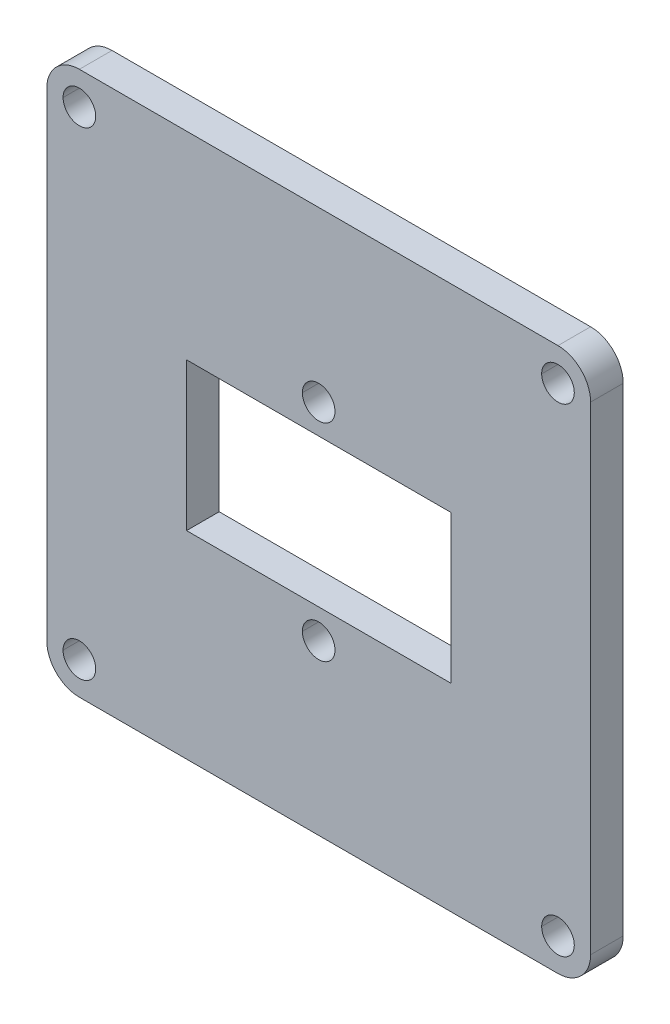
ISO-10303-21;
HEADER;
FILE_DESCRIPTION(('STEP AP214'),'2;1');
FILE_NAME('part.step','',(''),(''),'','','');
FILE_SCHEMA(('AUTOMOTIVE_DESIGN { 1 0 10303 214 1 1 1 1 }'));
ENDSEC;
DATA;
#1=APPLICATION_CONTEXT('core data for automotive mechanical design processes');
#2=APPLICATION_PROTOCOL_DEFINITION('international standard','automotive_design',2000,#1);
#3=PRODUCT_CONTEXT('',#1,'mechanical');
#4=PRODUCT('Part','Part','',(#3));
#5=PRODUCT_RELATED_PRODUCT_CATEGORY('part','',(#4));
#6=PRODUCT_DEFINITION_FORMATION('','',#4);
#7=PRODUCT_DEFINITION_CONTEXT('part definition',#1,'design');
#8=PRODUCT_DEFINITION('design','',#6,#7);
#9=PRODUCT_DEFINITION_SHAPE('','',#8);
#10=(LENGTH_UNIT() NAMED_UNIT(*) SI_UNIT(.MILLI.,.METRE.));
#11=(NAMED_UNIT(*) PLANE_ANGLE_UNIT() SI_UNIT($,.RADIAN.));
#12=(NAMED_UNIT(*) SI_UNIT($,.STERADIAN.) SOLID_ANGLE_UNIT());
#13=UNCERTAINTY_MEASURE_WITH_UNIT(LENGTH_MEASURE(1.E-05),#10,'distance_accuracy_value','');
#14=(GEOMETRIC_REPRESENTATION_CONTEXT(3) GLOBAL_UNCERTAINTY_ASSIGNED_CONTEXT((#13)) GLOBAL_UNIT_ASSIGNED_CONTEXT((#10,
#11,#12)) REPRESENTATION_CONTEXT('',''));
#15=CARTESIAN_POINT('',(0.,0.,0.));
#16=DIRECTION('',(0.,0.,1.));
#17=DIRECTION('',(1.,0.,0.));
#18=AXIS2_PLACEMENT_3D('',#15,#16,#17);
#19=CARTESIAN_POINT('',(25.1876211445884,-107.615333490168,0.));
#20=DIRECTION('',(0.,0.,1.));
#21=DIRECTION('',(1.,0.,0.));
#22=AXIS2_PLACEMENT_3D('',#19,#20,#21);
#23=PLANE('',#22);
#24=CARTESIAN_POINT('',(69.1876211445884,-107.615333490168,0.));
#25=DIRECTION('',(0.,0.,-1.));
#26=DIRECTION('',(-1.,0.,0.));
#27=AXIS2_PLACEMENT_3D('',#24,#25,#26);
#28=CIRCLE('',#27,1.5);
#29=CARTESIAN_POINT('',(70.6876211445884,-107.615333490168,0.));
#30=VERTEX_POINT('',#29);
#31=CARTESIAN_POINT('',(67.6876211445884,-107.615333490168,0.));
#32=VERTEX_POINT('',#31);
#33=EDGE_CURVE('E310',#30,#32,#28,.F.);
#34=ORIENTED_EDGE('',*,*,#33,.T.);
#35=CARTESIAN_POINT('',(69.1876211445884,-107.615333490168,0.));
#36=DIRECTION('',(0.,0.,-1.));
#37=DIRECTION('',(-1.,0.,0.));
#38=AXIS2_PLACEMENT_3D('',#35,#36,#37);
#39=CIRCLE('',#38,1.5);
#40=EDGE_CURVE('E33',#32,#30,#39,.F.);
#41=ORIENTED_EDGE('',*,*,#40,.T.);
#42=EDGE_LOOP('',(#34,#41));
#43=FACE_BOUND('',#42,.T.);
#44=CARTESIAN_POINT('',(25.1876211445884,-63.6153334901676,0.));
#45=DIRECTION('',(0.,0.,-1.));
#46=DIRECTION('',(-1.,0.,0.));
#47=AXIS2_PLACEMENT_3D('',#44,#45,#46);
#48=CIRCLE('',#47,1.5);
#49=CARTESIAN_POINT('',(26.6876211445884,-63.6153334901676,0.));
#50=VERTEX_POINT('',#49);
#51=CARTESIAN_POINT('',(23.6876211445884,-63.6153334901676,0.));
#52=VERTEX_POINT('',#51);
#53=EDGE_CURVE('E303',#50,#52,#48,.F.);
#54=ORIENTED_EDGE('',*,*,#53,.T.);
#55=CARTESIAN_POINT('',(25.1876211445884,-63.6153334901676,0.));
#56=DIRECTION('',(0.,0.,-1.));
#57=DIRECTION('',(-1.,0.,0.));
#58=AXIS2_PLACEMENT_3D('',#55,#56,#57);
#59=CIRCLE('',#58,1.5);
#60=EDGE_CURVE('E313',#52,#50,#59,.F.);
#61=ORIENTED_EDGE('',*,*,#60,.T.);
#62=EDGE_LOOP('',(#54,#61));
#63=FACE_BOUND('',#62,.T.);
#64=CARTESIAN_POINT('',(47.1876211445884,-76.1153334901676,0.));
#65=DIRECTION('',(0.,0.,-1.));
#66=DIRECTION('',(-1.,0.,0.));
#67=AXIS2_PLACEMENT_3D('',#64,#65,#66);
#68=CIRCLE('',#67,1.5);
#69=CARTESIAN_POINT('',(48.6876211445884,-76.1153334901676,0.));
#70=VERTEX_POINT('',#69);
#71=CARTESIAN_POINT('',(45.6876211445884,-76.1153334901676,0.));
#72=VERTEX_POINT('',#71);
#73=EDGE_CURVE('E297',#70,#72,#68,.F.);
#74=ORIENTED_EDGE('',*,*,#73,.T.);
#75=CARTESIAN_POINT('',(47.1876211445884,-76.1153334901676,0.));
#76=DIRECTION('',(0.,0.,-1.));
#77=DIRECTION('',(-1.,0.,0.));
#78=AXIS2_PLACEMENT_3D('',#75,#76,#77);
#79=CIRCLE('',#78,1.5);
#80=EDGE_CURVE('E306',#72,#70,#79,.F.);
#81=ORIENTED_EDGE('',*,*,#80,.T.);
#82=EDGE_LOOP('',(#74,#81));
#83=FACE_BOUND('',#82,.T.);
#84=DIRECTION('',(0.,1.,0.));
#85=VECTOR('',#84,1.);
#86=CARTESIAN_POINT('',(22.1876211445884,-63.6153334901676,0.));
#87=LINE('',#86,#85);
#88=CARTESIAN_POINT('',(22.1876211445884,-107.615333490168,0.));
#89=VERTEX_POINT('',#88);
#90=CARTESIAN_POINT('',(22.1876211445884,-63.6153334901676,0.));
#91=VERTEX_POINT('',#90);
#92=EDGE_CURVE('E272',#89,#91,#87,.T.);
#93=ORIENTED_EDGE('',*,*,#92,.T.);
#94=CARTESIAN_POINT('',(25.1876211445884,-63.6153334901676,0.));
#95=DIRECTION('',(0.,0.,-1.));
#96=DIRECTION('',(-1.,0.,0.));
#97=AXIS2_PLACEMENT_3D('',#94,#95,#96);
#98=CIRCLE('',#97,3.);
#99=CARTESIAN_POINT('',(25.1876211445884,-60.6153334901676,0.));
#100=VERTEX_POINT('',#99);
#101=EDGE_CURVE('E275',#100,#91,#98,.F.);
#102=ORIENTED_EDGE('',*,*,#101,.F.);
#103=DIRECTION('',(1.,0.,0.));
#104=VECTOR('',#103,1.);
#105=CARTESIAN_POINT('',(25.1876211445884,-60.6153334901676,0.));
#106=LINE('',#105,#104);
#107=CARTESIAN_POINT('',(69.1876211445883,-60.6153334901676,0.));
#108=VERTEX_POINT('',#107);
#109=EDGE_CURVE('E278',#100,#108,#106,.T.);
#110=ORIENTED_EDGE('',*,*,#109,.T.);
#111=CARTESIAN_POINT('',(69.1876211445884,-63.6153334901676,0.));
#112=DIRECTION('',(0.,0.,-1.));
#113=DIRECTION('',(-1.,0.,0.));
#114=AXIS2_PLACEMENT_3D('',#111,#112,#113);
#115=CIRCLE('',#114,3.);
#116=CARTESIAN_POINT('',(72.1876211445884,-63.6153334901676,0.));
#117=VERTEX_POINT('',#116);
#118=EDGE_CURVE('E282',#117,#108,#115,.F.);
#119=ORIENTED_EDGE('',*,*,#118,.F.);
#120=DIRECTION('',(0.,-1.,0.));
#121=VECTOR('',#120,1.);
#122=CARTESIAN_POINT('',(72.1876211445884,-63.6153334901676,0.));
#123=LINE('',#122,#121);
#124=CARTESIAN_POINT('',(72.1876211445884,-107.615333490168,0.));
#125=VERTEX_POINT('',#124);
#126=EDGE_CURVE('E285',#117,#125,#123,.T.);
#127=ORIENTED_EDGE('',*,*,#126,.T.);
#128=CARTESIAN_POINT('',(69.1876211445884,-107.615333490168,0.));
#129=DIRECTION('',(0.,0.,-1.));
#130=DIRECTION('',(-1.,0.,0.));
#131=AXIS2_PLACEMENT_3D('',#128,#129,#130);
#132=CIRCLE('',#131,3.);
#133=CARTESIAN_POINT('',(69.1876211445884,-110.615333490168,0.));
#134=VERTEX_POINT('',#133);
#135=EDGE_CURVE('E289',#134,#125,#132,.F.);
#136=ORIENTED_EDGE('',*,*,#135,.F.);
#137=DIRECTION('',(1.,0.,0.));
#138=VECTOR('',#137,1.);
#139=CARTESIAN_POINT('',(25.1876211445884,-110.615333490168,0.));
#140=LINE('',#139,#138);
#141=CARTESIAN_POINT('',(25.1876211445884,-110.615333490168,0.));
#142=VERTEX_POINT('',#141);
#143=EDGE_CURVE('E292',#134,#142,#140,.F.);
#144=ORIENTED_EDGE('',*,*,#143,.T.);
#145=CARTESIAN_POINT('',(25.1876211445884,-107.615333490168,0.));
#146=DIRECTION('',(0.,0.,-1.));
#147=DIRECTION('',(-1.,0.,0.));
#148=AXIS2_PLACEMENT_3D('',#145,#146,#147);
#149=CIRCLE('',#148,3.);
#150=EDGE_CURVE('E293',#89,#142,#149,.F.);
#151=ORIENTED_EDGE('',*,*,#150,.F.);
#152=EDGE_LOOP('',(#93,#102,#110,#119,#127,#136,#144,#151));
#153=FACE_BOUND('',#152,.T.);
#154=CARTESIAN_POINT('',(47.1876211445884,-95.1153334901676,0.));
#155=DIRECTION('',(0.,0.,-1.));
#156=DIRECTION('',(-1.,0.,0.));
#157=AXIS2_PLACEMENT_3D('',#154,#155,#156);
#158=CIRCLE('',#157,1.5);
#159=CARTESIAN_POINT('',(48.6876211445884,-95.1153334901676,0.));
#160=VERTEX_POINT('',#159);
#161=CARTESIAN_POINT('',(45.6876211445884,-95.1153334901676,0.));
#162=VERTEX_POINT('',#161);
#163=EDGE_CURVE('E262',#160,#162,#158,.F.);
#164=ORIENTED_EDGE('',*,*,#163,.T.);
#165=CARTESIAN_POINT('',(47.1876211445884,-95.1153334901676,0.));
#166=DIRECTION('',(0.,0.,-1.));
#167=DIRECTION('',(-1.,0.,0.));
#168=AXIS2_PLACEMENT_3D('',#165,#166,#167);
#169=CIRCLE('',#168,1.5);
#170=EDGE_CURVE('E316',#162,#160,#169,.F.);
#171=ORIENTED_EDGE('',*,*,#170,.T.);
#172=EDGE_LOOP('',(#164,#171));
#173=FACE_BOUND('',#172,.T.);
#174=CARTESIAN_POINT('',(25.1876211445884,-107.615333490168,0.));
#175=DIRECTION('',(0.,0.,-1.));
#176=DIRECTION('',(-1.,0.,0.));
#177=AXIS2_PLACEMENT_3D('',#174,#175,#176);
#178=CIRCLE('',#177,1.5);
#179=CARTESIAN_POINT('',(26.6876211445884,-107.615333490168,0.));
#180=VERTEX_POINT('',#179);
#181=CARTESIAN_POINT('',(23.6876211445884,-107.615333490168,0.));
#182=VERTEX_POINT('',#181);
#183=EDGE_CURVE('E255',#180,#182,#178,.F.);
#184=ORIENTED_EDGE('',*,*,#183,.T.);
#185=CARTESIAN_POINT('',(25.1876211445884,-107.615333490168,0.));
#186=DIRECTION('',(0.,0.,-1.));
#187=DIRECTION('',(-1.,0.,0.));
#188=AXIS2_PLACEMENT_3D('',#185,#186,#187);
#189=CIRCLE('',#188,1.5);
#190=EDGE_CURVE('E265',#182,#180,#189,.F.);
#191=ORIENTED_EDGE('',*,*,#190,.T.);
#192=EDGE_LOOP('',(#184,#191));
#193=FACE_BOUND('',#192,.T.);
#194=CARTESIAN_POINT('',(69.1876211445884,-63.6153334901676,0.));
#195=DIRECTION('',(0.,0.,-1.));
#196=DIRECTION('',(-1.,0.,0.));
#197=AXIS2_PLACEMENT_3D('',#194,#195,#196);
#198=CIRCLE('',#197,1.5);
#199=CARTESIAN_POINT('',(70.6876211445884,-63.6153334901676,0.));
#200=VERTEX_POINT('',#199);
#201=CARTESIAN_POINT('',(67.6876211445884,-63.6153334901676,0.));
#202=VERTEX_POINT('',#201);
#203=EDGE_CURVE('E248',#200,#202,#198,.F.);
#204=ORIENTED_EDGE('',*,*,#203,.T.);
#205=CARTESIAN_POINT('',(69.1876211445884,-63.6153334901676,0.));
#206=DIRECTION('',(0.,0.,-1.));
#207=DIRECTION('',(-1.,0.,0.));
#208=AXIS2_PLACEMENT_3D('',#205,#206,#207);
#209=CIRCLE('',#208,1.5);
#210=EDGE_CURVE('E258',#202,#200,#209,.F.);
#211=ORIENTED_EDGE('',*,*,#210,.T.);
#212=EDGE_LOOP('',(#204,#211));
#213=FACE_BOUND('',#212,.T.);
#214=DIRECTION('',(0.,-1.,0.));
#215=VECTOR('',#214,1.);
#216=CARTESIAN_POINT('',(35.04,-78.82,0.));
#217=LINE('',#216,#215);
#218=CARTESIAN_POINT('',(35.04,-78.82,0.));
#219=VERTEX_POINT('',#218);
#220=CARTESIAN_POINT('',(35.04,-92.42,0.));
#221=VERTEX_POINT('',#220);
#222=EDGE_CURVE('E46',#219,#221,#217,.T.);
#223=ORIENTED_EDGE('',*,*,#222,.T.);
#224=DIRECTION('',(1.,0.,0.));
#225=VECTOR('',#224,1.);
#226=CARTESIAN_POINT('',(35.04,-92.42,0.));
#227=LINE('',#226,#225);
#228=CARTESIAN_POINT('',(59.34,-92.42,0.));
#229=VERTEX_POINT('',#228);
#230=EDGE_CURVE('E207',#221,#229,#227,.T.);
#231=ORIENTED_EDGE('',*,*,#230,.T.);
#232=DIRECTION('',(0.,1.,0.));
#233=VECTOR('',#232,1.);
#234=CARTESIAN_POINT('',(59.34,-78.82,0.));
#235=LINE('',#234,#233);
#236=CARTESIAN_POINT('',(59.34,-78.82,0.));
#237=VERTEX_POINT('',#236);
#238=EDGE_CURVE('E220',#229,#237,#235,.T.);
#239=ORIENTED_EDGE('',*,*,#238,.T.);
#240=DIRECTION('',(-1.,0.,0.));
#241=VECTOR('',#240,1.);
#242=CARTESIAN_POINT('',(35.04,-78.82,0.));
#243=LINE('',#242,#241);
#244=EDGE_CURVE('E201',#237,#219,#243,.T.);
#245=ORIENTED_EDGE('',*,*,#244,.T.);
#246=EDGE_LOOP('',(#223,#231,#239,#245));
#247=FACE_BOUND('',#246,.T.);
#248=ADVANCED_FACE('F30',(#43,#63,#83,#153,#173,#193,#213,#247),#23,.F.);
#249=CARTESIAN_POINT('',(25.1876211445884,-107.615333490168,3.));
#250=DIRECTION('',(0.,0.,1.));
#251=DIRECTION('',(1.,0.,0.));
#252=AXIS2_PLACEMENT_3D('',#249,#250,#251);
#253=PLANE('',#252);
#254=CARTESIAN_POINT('',(69.1876211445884,-107.615333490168,3.));
#255=DIRECTION('',(0.,0.,-1.));
#256=DIRECTION('',(-1.,0.,0.));
#257=AXIS2_PLACEMENT_3D('',#254,#255,#256);
#258=CIRCLE('',#257,1.5);
#259=CARTESIAN_POINT('',(70.6876211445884,-107.615333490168,3.));
#260=VERTEX_POINT('',#259);
#261=CARTESIAN_POINT('',(67.6876211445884,-107.615333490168,3.));
#262=VERTEX_POINT('',#261);
#263=EDGE_CURVE('E251',#260,#262,#258,.T.);
#264=ORIENTED_EDGE('',*,*,#263,.T.);
#265=CARTESIAN_POINT('',(69.1876211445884,-107.615333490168,3.));
#266=DIRECTION('',(0.,0.,-1.));
#267=DIRECTION('',(-1.,0.,0.));
#268=AXIS2_PLACEMENT_3D('',#265,#266,#267);
#269=CIRCLE('',#268,1.5);
#270=EDGE_CURVE('E356',#262,#260,#269,.T.);
#271=ORIENTED_EDGE('',*,*,#270,.T.);
#272=EDGE_LOOP('',(#264,#271));
#273=FACE_BOUND('',#272,.T.);
#274=CARTESIAN_POINT('',(25.1876211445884,-63.6153334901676,3.));
#275=DIRECTION('',(0.,0.,-1.));
#276=DIRECTION('',(-1.,0.,0.));
#277=AXIS2_PLACEMENT_3D('',#274,#275,#276);
#278=CIRCLE('',#277,1.5);
#279=CARTESIAN_POINT('',(26.6876211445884,-63.6153334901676,3.));
#280=VERTEX_POINT('',#279);
#281=CARTESIAN_POINT('',(23.6876211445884,-63.6153334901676,3.));
#282=VERTEX_POINT('',#281);
#283=EDGE_CURVE('E353',#280,#282,#278,.T.);
#284=ORIENTED_EDGE('',*,*,#283,.T.);
#285=CARTESIAN_POINT('',(25.1876211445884,-63.6153334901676,3.));
#286=DIRECTION('',(0.,0.,-1.));
#287=DIRECTION('',(-1.,0.,0.));
#288=AXIS2_PLACEMENT_3D('',#285,#286,#287);
#289=CIRCLE('',#288,1.5);
#290=EDGE_CURVE('E350',#282,#280,#289,.T.);
#291=ORIENTED_EDGE('',*,*,#290,.T.);
#292=EDGE_LOOP('',(#284,#291));
#293=FACE_BOUND('',#292,.T.);
#294=CARTESIAN_POINT('',(47.1876211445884,-76.1153334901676,3.));
#295=DIRECTION('',(0.,0.,-1.));
#296=DIRECTION('',(-1.,0.,0.));
#297=AXIS2_PLACEMENT_3D('',#294,#295,#296);
#298=CIRCLE('',#297,1.5);
#299=CARTESIAN_POINT('',(48.6876211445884,-76.1153334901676,3.));
#300=VERTEX_POINT('',#299);
#301=CARTESIAN_POINT('',(45.6876211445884,-76.1153334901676,3.));
#302=VERTEX_POINT('',#301);
#303=EDGE_CURVE('E347',#300,#302,#298,.T.);
#304=ORIENTED_EDGE('',*,*,#303,.T.);
#305=CARTESIAN_POINT('',(47.1876211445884,-76.1153334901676,3.));
#306=DIRECTION('',(0.,0.,-1.));
#307=DIRECTION('',(-1.,0.,0.));
#308=AXIS2_PLACEMENT_3D('',#305,#306,#307);
#309=CIRCLE('',#308,1.5);
#310=EDGE_CURVE('E344',#302,#300,#309,.T.);
#311=ORIENTED_EDGE('',*,*,#310,.T.);
#312=EDGE_LOOP('',(#304,#311));
#313=FACE_BOUND('',#312,.T.);
#314=CARTESIAN_POINT('',(25.1876211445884,-63.6153334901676,3.));
#315=DIRECTION('',(0.,0.,-1.));
#316=DIRECTION('',(-1.,0.,0.));
#317=AXIS2_PLACEMENT_3D('',#314,#315,#316);
#318=CIRCLE('',#317,3.);
#319=CARTESIAN_POINT('',(25.1876211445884,-60.6153334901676,3.));
#320=VERTEX_POINT('',#319);
#321=CARTESIAN_POINT('',(22.1876211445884,-63.6153334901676,3.));
#322=VERTEX_POINT('',#321);
#323=EDGE_CURVE('E232',#320,#322,#318,.F.);
#324=ORIENTED_EDGE('',*,*,#323,.T.);
#325=DIRECTION('',(0.,1.,0.));
#326=VECTOR('',#325,1.);
#327=CARTESIAN_POINT('',(22.1876211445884,-107.615333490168,3.));
#328=LINE('',#327,#326);
#329=CARTESIAN_POINT('',(22.1876211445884,-107.615333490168,3.));
#330=VERTEX_POINT('',#329);
#331=EDGE_CURVE('E228',#322,#330,#328,.F.);
#332=ORIENTED_EDGE('',*,*,#331,.T.);
#333=CARTESIAN_POINT('',(25.1876211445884,-107.615333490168,3.));
#334=DIRECTION('',(0.,0.,-1.));
#335=DIRECTION('',(-1.,0.,0.));
#336=AXIS2_PLACEMENT_3D('',#333,#334,#335);
#337=CIRCLE('',#336,3.);
#338=CARTESIAN_POINT('',(25.1876211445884,-110.615333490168,3.));
#339=VERTEX_POINT('',#338);
#340=EDGE_CURVE('E244',#330,#339,#337,.F.);
#341=ORIENTED_EDGE('',*,*,#340,.T.);
#342=DIRECTION('',(1.,0.,0.));
#343=VECTOR('',#342,1.);
#344=CARTESIAN_POINT('',(25.1876211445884,-110.615333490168,3.));
#345=LINE('',#344,#343);
#346=CARTESIAN_POINT('',(69.1876211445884,-110.615333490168,3.));
#347=VERTEX_POINT('',#346);
#348=EDGE_CURVE('E241',#339,#347,#345,.T.);
#349=ORIENTED_EDGE('',*,*,#348,.T.);
#350=CARTESIAN_POINT('',(69.1876211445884,-107.615333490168,3.));
#351=DIRECTION('',(0.,0.,-1.));
#352=DIRECTION('',(-1.,0.,0.));
#353=AXIS2_PLACEMENT_3D('',#350,#351,#352);
#354=CIRCLE('',#353,3.);
#355=CARTESIAN_POINT('',(72.1876211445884,-107.615333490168,3.));
#356=VERTEX_POINT('',#355);
#357=EDGE_CURVE('E240',#347,#356,#354,.F.);
#358=ORIENTED_EDGE('',*,*,#357,.T.);
#359=DIRECTION('',(0.,1.,0.));
#360=VECTOR('',#359,1.);
#361=CARTESIAN_POINT('',(72.1876211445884,-107.615333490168,3.));
#362=LINE('',#361,#360);
#363=CARTESIAN_POINT('',(72.1876211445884,-63.6153334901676,3.));
#364=VERTEX_POINT('',#363);
#365=EDGE_CURVE('E237',#356,#364,#362,.T.);
#366=ORIENTED_EDGE('',*,*,#365,.T.);
#367=CARTESIAN_POINT('',(69.1876211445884,-63.6153334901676,3.));
#368=DIRECTION('',(0.,0.,-1.));
#369=DIRECTION('',(-1.,0.,0.));
#370=AXIS2_PLACEMENT_3D('',#367,#368,#369);
#371=CIRCLE('',#370,3.);
#372=CARTESIAN_POINT('',(69.1876211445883,-60.6153334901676,3.));
#373=VERTEX_POINT('',#372);
#374=EDGE_CURVE('E236',#364,#373,#371,.F.);
#375=ORIENTED_EDGE('',*,*,#374,.T.);
#376=DIRECTION('',(1.,0.,0.));
#377=VECTOR('',#376,1.);
#378=CARTESIAN_POINT('',(25.1876211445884,-60.6153334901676,3.));
#379=LINE('',#378,#377);
#380=EDGE_CURVE('E233',#373,#320,#379,.F.);
#381=ORIENTED_EDGE('',*,*,#380,.T.);
#382=EDGE_LOOP('',(#324,#332,#341,#349,#358,#366,#375,#381));
#383=FACE_BOUND('',#382,.T.);
#384=CARTESIAN_POINT('',(47.1876211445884,-95.1153334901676,3.));
#385=DIRECTION('',(0.,0.,-1.));
#386=DIRECTION('',(-1.,0.,0.));
#387=AXIS2_PLACEMENT_3D('',#384,#385,#386);
#388=CIRCLE('',#387,1.5);
#389=CARTESIAN_POINT('',(48.6876211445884,-95.1153334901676,3.));
#390=VERTEX_POINT('',#389);
#391=CARTESIAN_POINT('',(45.6876211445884,-95.1153334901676,3.));
#392=VERTEX_POINT('',#391);
#393=EDGE_CURVE('E231',#390,#392,#388,.T.);
#394=ORIENTED_EDGE('',*,*,#393,.T.);
#395=CARTESIAN_POINT('',(47.1876211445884,-95.1153334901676,3.));
#396=DIRECTION('',(0.,0.,-1.));
#397=DIRECTION('',(-1.,0.,0.));
#398=AXIS2_PLACEMENT_3D('',#395,#396,#397);
#399=CIRCLE('',#398,1.5);
#400=EDGE_CURVE('E331',#392,#390,#399,.T.);
#401=ORIENTED_EDGE('',*,*,#400,.T.);
#402=EDGE_LOOP('',(#394,#401));
#403=FACE_BOUND('',#402,.T.);
#404=CARTESIAN_POINT('',(25.1876211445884,-107.615333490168,3.));
#405=DIRECTION('',(0.,0.,-1.));
#406=DIRECTION('',(-1.,0.,0.));
#407=AXIS2_PLACEMENT_3D('',#404,#405,#406);
#408=CIRCLE('',#407,1.5);
#409=CARTESIAN_POINT('',(26.6876211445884,-107.615333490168,3.));
#410=VERTEX_POINT('',#409);
#411=CARTESIAN_POINT('',(23.6876211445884,-107.615333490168,3.));
#412=VERTEX_POINT('',#411);
#413=EDGE_CURVE('E328',#410,#412,#408,.T.);
#414=ORIENTED_EDGE('',*,*,#413,.T.);
#415=CARTESIAN_POINT('',(25.1876211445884,-107.615333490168,3.));
#416=DIRECTION('',(0.,0.,-1.));
#417=DIRECTION('',(-1.,0.,0.));
#418=AXIS2_PLACEMENT_3D('',#415,#416,#417);
#419=CIRCLE('',#418,1.5);
#420=EDGE_CURVE('E325',#412,#410,#419,.T.);
#421=ORIENTED_EDGE('',*,*,#420,.T.);
#422=EDGE_LOOP('',(#414,#421));
#423=FACE_BOUND('',#422,.T.);
#424=CARTESIAN_POINT('',(69.1876211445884,-63.6153334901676,3.));
#425=DIRECTION('',(0.,0.,-1.));
#426=DIRECTION('',(-1.,0.,0.));
#427=AXIS2_PLACEMENT_3D('',#424,#425,#426);
#428=CIRCLE('',#427,1.5);
#429=CARTESIAN_POINT('',(70.6876211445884,-63.6153334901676,3.));
#430=VERTEX_POINT('',#429);
#431=CARTESIAN_POINT('',(67.6876211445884,-63.6153334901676,3.));
#432=VERTEX_POINT('',#431);
#433=EDGE_CURVE('E38',#430,#432,#428,.T.);
#434=ORIENTED_EDGE('',*,*,#433,.T.);
#435=CARTESIAN_POINT('',(69.1876211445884,-63.6153334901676,3.));
#436=DIRECTION('',(0.,0.,-1.));
#437=DIRECTION('',(-1.,0.,0.));
#438=AXIS2_PLACEMENT_3D('',#435,#436,#437);
#439=CIRCLE('',#438,1.5);
#440=EDGE_CURVE('E11',#432,#430,#439,.T.);
#441=ORIENTED_EDGE('',*,*,#440,.T.);
#442=EDGE_LOOP('',(#434,#441));
#443=FACE_BOUND('',#442,.T.);
#444=DIRECTION('',(1.,0.,0.));
#445=VECTOR('',#444,1.);
#446=CARTESIAN_POINT('',(35.04,-92.42,3.));
#447=LINE('',#446,#445);
#448=CARTESIAN_POINT('',(35.04,-92.42,3.));
#449=VERTEX_POINT('',#448);
#450=CARTESIAN_POINT('',(59.34,-92.42,3.));
#451=VERTEX_POINT('',#450);
#452=EDGE_CURVE('E200',#449,#451,#447,.T.);
#453=ORIENTED_EDGE('',*,*,#452,.F.);
#454=DIRECTION('',(0.,-1.,0.));
#455=VECTOR('',#454,1.);
#456=CARTESIAN_POINT('',(35.04,-78.82,3.));
#457=LINE('',#456,#455);
#458=CARTESIAN_POINT('',(35.04,-78.82,3.));
#459=VERTEX_POINT('',#458);
#460=EDGE_CURVE('E192',#459,#449,#457,.T.);
#461=ORIENTED_EDGE('',*,*,#460,.F.);
#462=DIRECTION('',(-1.,0.,0.));
#463=VECTOR('',#462,1.);
#464=CARTESIAN_POINT('',(35.04,-78.82,3.));
#465=LINE('',#464,#463);
#466=CARTESIAN_POINT('',(59.34,-78.82,3.));
#467=VERTEX_POINT('',#466);
#468=EDGE_CURVE('E214',#467,#459,#465,.T.);
#469=ORIENTED_EDGE('',*,*,#468,.F.);
#470=DIRECTION('',(0.,1.,0.));
#471=VECTOR('',#470,1.);
#472=CARTESIAN_POINT('',(59.34,-78.82,3.));
#473=LINE('',#472,#471);
#474=EDGE_CURVE('E212',#451,#467,#473,.T.);
#475=ORIENTED_EDGE('',*,*,#474,.F.);
#476=EDGE_LOOP('',(#453,#461,#469,#475));
#477=FACE_BOUND('',#476,.T.);
#478=ADVANCED_FACE('F211',(#273,#293,#313,#383,#403,#423,#443,#477),#253,.T.);
#479=CARTESIAN_POINT('',(69.1876211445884,-107.615333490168,3.));
#480=DIRECTION('',(0.,0.,-1.));
#481=DIRECTION('',(-1.,0.,0.));
#482=AXIS2_PLACEMENT_3D('',#479,#480,#481);
#483=CYLINDRICAL_SURFACE('',#482,1.5);
#484=DIRECTION('',(0.,0.,-1.));
#485=VECTOR('',#484,1.);
#486=CARTESIAN_POINT('',(70.6876211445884,-107.615333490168,3.));
#487=LINE('',#486,#485);
#488=EDGE_CURVE('E309',#260,#30,#487,.T.);
#489=ORIENTED_EDGE('',*,*,#488,.T.);
#490=ORIENTED_EDGE('',*,*,#40,.F.);
#491=DIRECTION('',(0.,0.,-1.));
#492=VECTOR('',#491,1.);
#493=CARTESIAN_POINT('',(67.6876211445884,-107.615333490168,3.));
#494=LINE('',#493,#492);
#495=EDGE_CURVE('E307',#32,#262,#494,.F.);
#496=ORIENTED_EDGE('',*,*,#495,.T.);
#497=ORIENTED_EDGE('',*,*,#263,.F.);
#498=EDGE_LOOP('',(#489,#490,#496,#497));
#499=FACE_BOUND('',#498,.T.);
#500=ADVANCED_FACE('F381',(#499),#483,.F.);
#501=CARTESIAN_POINT('',(69.1876211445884,-107.615333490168,3.));
#502=DIRECTION('',(0.,0.,-1.));
#503=DIRECTION('',(-1.,0.,0.));
#504=AXIS2_PLACEMENT_3D('',#501,#502,#503);
#505=CYLINDRICAL_SURFACE('',#504,1.5);
#506=ORIENTED_EDGE('',*,*,#270,.F.);
#507=ORIENTED_EDGE('',*,*,#495,.F.);
#508=ORIENTED_EDGE('',*,*,#33,.F.);
#509=ORIENTED_EDGE('',*,*,#488,.F.);
#510=EDGE_LOOP('',(#506,#507,#508,#509));
#511=FACE_BOUND('',#510,.T.);
#512=ADVANCED_FACE('F384',(#511),#505,.F.);
#513=CARTESIAN_POINT('',(25.1876211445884,-63.6153334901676,3.));
#514=DIRECTION('',(0.,0.,-1.));
#515=DIRECTION('',(-1.,0.,0.));
#516=AXIS2_PLACEMENT_3D('',#513,#514,#515);
#517=CYLINDRICAL_SURFACE('',#516,1.5);
#518=DIRECTION('',(0.,0.,-1.));
#519=VECTOR('',#518,1.);
#520=CARTESIAN_POINT('',(26.6876211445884,-63.6153334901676,3.));
#521=LINE('',#520,#519);
#522=EDGE_CURVE('E302',#280,#50,#521,.T.);
#523=ORIENTED_EDGE('',*,*,#522,.T.);
#524=ORIENTED_EDGE('',*,*,#60,.F.);
#525=DIRECTION('',(0.,0.,-1.));
#526=VECTOR('',#525,1.);
#527=CARTESIAN_POINT('',(23.6876211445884,-63.6153334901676,3.));
#528=LINE('',#527,#526);
#529=EDGE_CURVE('E300',#52,#282,#528,.F.);
#530=ORIENTED_EDGE('',*,*,#529,.T.);
#531=ORIENTED_EDGE('',*,*,#283,.F.);
#532=EDGE_LOOP('',(#523,#524,#530,#531));
#533=FACE_BOUND('',#532,.T.);
#534=ADVANCED_FACE('F485',(#533),#517,.F.);
#535=CARTESIAN_POINT('',(25.1876211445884,-63.6153334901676,3.));
#536=DIRECTION('',(0.,0.,-1.));
#537=DIRECTION('',(-1.,0.,0.));
#538=AXIS2_PLACEMENT_3D('',#535,#536,#537);
#539=CYLINDRICAL_SURFACE('',#538,1.5);
#540=ORIENTED_EDGE('',*,*,#290,.F.);
#541=ORIENTED_EDGE('',*,*,#529,.F.);
#542=ORIENTED_EDGE('',*,*,#53,.F.);
#543=ORIENTED_EDGE('',*,*,#522,.F.);
#544=EDGE_LOOP('',(#540,#541,#542,#543));
#545=FACE_BOUND('',#544,.T.);
#546=ADVANCED_FACE('F481',(#545),#539,.F.);
#547=CARTESIAN_POINT('',(47.1876211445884,-76.1153334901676,3.));
#548=DIRECTION('',(0.,0.,-1.));
#549=DIRECTION('',(-1.,0.,0.));
#550=AXIS2_PLACEMENT_3D('',#547,#548,#549);
#551=CYLINDRICAL_SURFACE('',#550,1.5);
#552=DIRECTION('',(0.,0.,-1.));
#553=VECTOR('',#552,1.);
#554=CARTESIAN_POINT('',(48.6876211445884,-76.1153334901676,3.));
#555=LINE('',#554,#553);
#556=EDGE_CURVE('E296',#300,#70,#555,.T.);
#557=ORIENTED_EDGE('',*,*,#556,.T.);
#558=ORIENTED_EDGE('',*,*,#80,.F.);
#559=DIRECTION('',(0.,0.,-1.));
#560=VECTOR('',#559,1.);
#561=CARTESIAN_POINT('',(45.6876211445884,-76.1153334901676,3.));
#562=LINE('',#561,#560);
#563=EDGE_CURVE('E294',#72,#302,#562,.F.);
#564=ORIENTED_EDGE('',*,*,#563,.T.);
#565=ORIENTED_EDGE('',*,*,#303,.F.);
#566=EDGE_LOOP('',(#557,#558,#564,#565));
#567=FACE_BOUND('',#566,.T.);
#568=ADVANCED_FACE('F477',(#567),#551,.F.);
#569=CARTESIAN_POINT('',(47.1876211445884,-76.1153334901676,3.));
#570=DIRECTION('',(0.,0.,-1.));
#571=DIRECTION('',(-1.,0.,0.));
#572=AXIS2_PLACEMENT_3D('',#569,#570,#571);
#573=CYLINDRICAL_SURFACE('',#572,1.5);
#574=ORIENTED_EDGE('',*,*,#310,.F.);
#575=ORIENTED_EDGE('',*,*,#563,.F.);
#576=ORIENTED_EDGE('',*,*,#73,.F.);
#577=ORIENTED_EDGE('',*,*,#556,.F.);
#578=EDGE_LOOP('',(#574,#575,#576,#577));
#579=FACE_BOUND('',#578,.T.);
#580=ADVANCED_FACE('F473',(#579),#573,.F.);
#581=CARTESIAN_POINT('',(25.1876211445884,-107.615333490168,3.));
#582=DIRECTION('',(0.,0.,-1.));
#583=DIRECTION('',(-1.,0.,0.));
#584=AXIS2_PLACEMENT_3D('',#581,#582,#583);
#585=CYLINDRICAL_SURFACE('',#584,3.);
#586=ORIENTED_EDGE('',*,*,#340,.F.);
#587=DIRECTION('',(0.,0.,1.));
#588=VECTOR('',#587,1.);
#589=CARTESIAN_POINT('',(22.1876211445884,-107.615333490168,3.));
#590=LINE('',#589,#588);
#591=EDGE_CURVE('E268',#330,#89,#590,.F.);
#592=ORIENTED_EDGE('',*,*,#591,.T.);
#593=ORIENTED_EDGE('',*,*,#150,.T.);
#594=DIRECTION('',(0.,0.,1.));
#595=VECTOR('',#594,1.);
#596=CARTESIAN_POINT('',(25.1876211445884,-110.615333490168,3.));
#597=LINE('',#596,#595);
#598=EDGE_CURVE('E290',#142,#339,#597,.T.);
#599=ORIENTED_EDGE('',*,*,#598,.T.);
#600=EDGE_LOOP('',(#586,#592,#593,#599));
#601=FACE_BOUND('',#600,.T.);
#602=ADVANCED_FACE('F469',(#601),#585,.T.);
#603=CARTESIAN_POINT('',(25.1876211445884,-110.615333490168,3.));
#604=DIRECTION('',(0.,1.,0.));
#605=DIRECTION('',(0.,0.,1.));
#606=AXIS2_PLACEMENT_3D('',#603,#604,#605);
#607=PLANE('',#606);
#608=DIRECTION('',(0.,0.,-1.));
#609=VECTOR('',#608,1.);
#610=CARTESIAN_POINT('',(69.1876211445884,-110.615333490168,3.));
#611=LINE('',#610,#609);
#612=EDGE_CURVE('E286',#347,#134,#611,.T.);
#613=ORIENTED_EDGE('',*,*,#612,.F.);
#614=ORIENTED_EDGE('',*,*,#348,.F.);
#615=ORIENTED_EDGE('',*,*,#598,.F.);
#616=ORIENTED_EDGE('',*,*,#143,.F.);
#617=EDGE_LOOP('',(#613,#614,#615,#616));
#618=FACE_BOUND('',#617,.T.);
#619=ADVANCED_FACE('F465',(#618),#607,.F.);
#620=CARTESIAN_POINT('',(69.1876211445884,-107.615333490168,3.));
#621=DIRECTION('',(0.,0.,-1.));
#622=DIRECTION('',(-1.,0.,0.));
#623=AXIS2_PLACEMENT_3D('',#620,#621,#622);
#624=CYLINDRICAL_SURFACE('',#623,3.);
#625=ORIENTED_EDGE('',*,*,#357,.F.);
#626=ORIENTED_EDGE('',*,*,#612,.T.);
#627=ORIENTED_EDGE('',*,*,#135,.T.);
#628=DIRECTION('',(0.,0.,1.));
#629=VECTOR('',#628,1.);
#630=CARTESIAN_POINT('',(72.1876211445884,-107.615333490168,3.));
#631=LINE('',#630,#629);
#632=EDGE_CURVE('E283',#125,#356,#631,.T.);
#633=ORIENTED_EDGE('',*,*,#632,.T.);
#634=EDGE_LOOP('',(#625,#626,#627,#633));
#635=FACE_BOUND('',#634,.T.);
#636=ADVANCED_FACE('F461',(#635),#624,.T.);
#637=CARTESIAN_POINT('',(72.1876211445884,-63.6153334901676,3.));
#638=DIRECTION('',(-1.,0.,0.));
#639=DIRECTION('',(0.,-1.,0.));
#640=AXIS2_PLACEMENT_3D('',#637,#638,#639);
#641=PLANE('',#640);
#642=DIRECTION('',(0.,0.,-1.));
#643=VECTOR('',#642,1.);
#644=CARTESIAN_POINT('',(72.1876211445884,-63.6153334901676,3.));
#645=LINE('',#644,#643);
#646=EDGE_CURVE('E279',#364,#117,#645,.T.);
#647=ORIENTED_EDGE('',*,*,#646,.F.);
#648=ORIENTED_EDGE('',*,*,#365,.F.);
#649=ORIENTED_EDGE('',*,*,#632,.F.);
#650=ORIENTED_EDGE('',*,*,#126,.F.);
#651=EDGE_LOOP('',(#647,#648,#649,#650));
#652=FACE_BOUND('',#651,.T.);
#653=ADVANCED_FACE('F457',(#652),#641,.F.);
#654=CARTESIAN_POINT('',(69.1876211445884,-63.6153334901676,3.));
#655=DIRECTION('',(0.,0.,-1.));
#656=DIRECTION('',(-1.,0.,0.));
#657=AXIS2_PLACEMENT_3D('',#654,#655,#656);
#658=CYLINDRICAL_SURFACE('',#657,3.);
#659=ORIENTED_EDGE('',*,*,#374,.F.);
#660=ORIENTED_EDGE('',*,*,#646,.T.);
#661=ORIENTED_EDGE('',*,*,#118,.T.);
#662=DIRECTION('',(0.,0.,1.));
#663=VECTOR('',#662,1.);
#664=CARTESIAN_POINT('',(69.1876211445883,-60.6153334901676,3.));
#665=LINE('',#664,#663);
#666=EDGE_CURVE('E276',#108,#373,#665,.T.);
#667=ORIENTED_EDGE('',*,*,#666,.T.);
#668=EDGE_LOOP('',(#659,#660,#661,#667));
#669=FACE_BOUND('',#668,.T.);
#670=ADVANCED_FACE('F453',(#669),#658,.T.);
#671=CARTESIAN_POINT('',(25.1876211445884,-60.6153334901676,3.));
#672=DIRECTION('',(0.,-1.,0.));
#673=DIRECTION('',(1.,0.,0.));
#674=AXIS2_PLACEMENT_3D('',#671,#672,#673);
#675=PLANE('',#674);
#676=DIRECTION('',(0.,0.,-1.));
#677=VECTOR('',#676,1.);
#678=CARTESIAN_POINT('',(25.1876211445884,-60.6153334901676,3.));
#679=LINE('',#678,#677);
#680=EDGE_CURVE('E269',#320,#100,#679,.T.);
#681=ORIENTED_EDGE('',*,*,#680,.F.);
#682=ORIENTED_EDGE('',*,*,#380,.F.);
#683=ORIENTED_EDGE('',*,*,#666,.F.);
#684=ORIENTED_EDGE('',*,*,#109,.F.);
#685=EDGE_LOOP('',(#681,#682,#683,#684));
#686=FACE_BOUND('',#685,.T.);
#687=ADVANCED_FACE('F449',(#686),#675,.F.);
#688=CARTESIAN_POINT('',(25.1876211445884,-63.6153334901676,3.));
#689=DIRECTION('',(0.,0.,-1.));
#690=DIRECTION('',(-1.,0.,0.));
#691=AXIS2_PLACEMENT_3D('',#688,#689,#690);
#692=CYLINDRICAL_SURFACE('',#691,3.);
#693=ORIENTED_EDGE('',*,*,#323,.F.);
#694=ORIENTED_EDGE('',*,*,#680,.T.);
#695=ORIENTED_EDGE('',*,*,#101,.T.);
#696=DIRECTION('',(0.,0.,1.));
#697=VECTOR('',#696,1.);
#698=CARTESIAN_POINT('',(22.1876211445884,-63.6153334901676,3.));
#699=LINE('',#698,#697);
#700=EDGE_CURVE('E266',#91,#322,#699,.T.);
#701=ORIENTED_EDGE('',*,*,#700,.T.);
#702=EDGE_LOOP('',(#693,#694,#695,#701));
#703=FACE_BOUND('',#702,.T.);
#704=ADVANCED_FACE('F445',(#703),#692,.T.);
#705=CARTESIAN_POINT('',(22.1876211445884,-63.6153334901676,3.));
#706=DIRECTION('',(1.,0.,0.));
#707=DIRECTION('',(0.,1.,0.));
#708=AXIS2_PLACEMENT_3D('',#705,#706,#707);
#709=PLANE('',#708);
#710=ORIENTED_EDGE('',*,*,#591,.F.);
#711=ORIENTED_EDGE('',*,*,#331,.F.);
#712=ORIENTED_EDGE('',*,*,#700,.F.);
#713=ORIENTED_EDGE('',*,*,#92,.F.);
#714=EDGE_LOOP('',(#710,#711,#712,#713));
#715=FACE_BOUND('',#714,.T.);
#716=ADVANCED_FACE('F441',(#715),#709,.F.);
#717=CARTESIAN_POINT('',(47.1876211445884,-95.1153334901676,3.));
#718=DIRECTION('',(0.,0.,-1.));
#719=DIRECTION('',(-1.,0.,0.));
#720=AXIS2_PLACEMENT_3D('',#717,#718,#719);
#721=CYLINDRICAL_SURFACE('',#720,1.5);
#722=DIRECTION('',(0.,0.,-1.));
#723=VECTOR('',#722,1.);
#724=CARTESIAN_POINT('',(48.6876211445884,-95.1153334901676,3.));
#725=LINE('',#724,#723);
#726=EDGE_CURVE('E261',#390,#160,#725,.T.);
#727=ORIENTED_EDGE('',*,*,#726,.T.);
#728=ORIENTED_EDGE('',*,*,#170,.F.);
#729=DIRECTION('',(0.,0.,-1.));
#730=VECTOR('',#729,1.);
#731=CARTESIAN_POINT('',(45.6876211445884,-95.1153334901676,3.));
#732=LINE('',#731,#730);
#733=EDGE_CURVE('E259',#162,#392,#732,.F.);
#734=ORIENTED_EDGE('',*,*,#733,.T.);
#735=ORIENTED_EDGE('',*,*,#393,.F.);
#736=EDGE_LOOP('',(#727,#728,#734,#735));
#737=FACE_BOUND('',#736,.T.);
#738=ADVANCED_FACE('F437',(#737),#721,.F.);
#739=CARTESIAN_POINT('',(47.1876211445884,-95.1153334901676,3.));
#740=DIRECTION('',(0.,0.,-1.));
#741=DIRECTION('',(-1.,0.,0.));
#742=AXIS2_PLACEMENT_3D('',#739,#740,#741);
#743=CYLINDRICAL_SURFACE('',#742,1.5);
#744=ORIENTED_EDGE('',*,*,#400,.F.);
#745=ORIENTED_EDGE('',*,*,#733,.F.);
#746=ORIENTED_EDGE('',*,*,#163,.F.);
#747=ORIENTED_EDGE('',*,*,#726,.F.);
#748=EDGE_LOOP('',(#744,#745,#746,#747));
#749=FACE_BOUND('',#748,.T.);
#750=ADVANCED_FACE('F433',(#749),#743,.F.);
#751=CARTESIAN_POINT('',(25.1876211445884,-107.615333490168,3.));
#752=DIRECTION('',(0.,0.,-1.));
#753=DIRECTION('',(-1.,0.,0.));
#754=AXIS2_PLACEMENT_3D('',#751,#752,#753);
#755=CYLINDRICAL_SURFACE('',#754,1.5);
#756=DIRECTION('',(0.,0.,-1.));
#757=VECTOR('',#756,1.);
#758=CARTESIAN_POINT('',(26.6876211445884,-107.615333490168,3.));
#759=LINE('',#758,#757);
#760=EDGE_CURVE('E254',#410,#180,#759,.T.);
#761=ORIENTED_EDGE('',*,*,#760,.T.);
#762=ORIENTED_EDGE('',*,*,#190,.F.);
#763=DIRECTION('',(0.,0.,-1.));
#764=VECTOR('',#763,1.);
#765=CARTESIAN_POINT('',(23.6876211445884,-107.615333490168,3.));
#766=LINE('',#765,#764);
#767=EDGE_CURVE('E252',#182,#412,#766,.F.);
#768=ORIENTED_EDGE('',*,*,#767,.T.);
#769=ORIENTED_EDGE('',*,*,#413,.F.);
#770=EDGE_LOOP('',(#761,#762,#768,#769));
#771=FACE_BOUND('',#770,.T.);
#772=ADVANCED_FACE('F429',(#771),#755,.F.);
#773=CARTESIAN_POINT('',(25.1876211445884,-107.615333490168,3.));
#774=DIRECTION('',(0.,0.,-1.));
#775=DIRECTION('',(-1.,0.,0.));
#776=AXIS2_PLACEMENT_3D('',#773,#774,#775);
#777=CYLINDRICAL_SURFACE('',#776,1.5);
#778=ORIENTED_EDGE('',*,*,#420,.F.);
#779=ORIENTED_EDGE('',*,*,#767,.F.);
#780=ORIENTED_EDGE('',*,*,#183,.F.);
#781=ORIENTED_EDGE('',*,*,#760,.F.);
#782=EDGE_LOOP('',(#778,#779,#780,#781));
#783=FACE_BOUND('',#782,.T.);
#784=ADVANCED_FACE('F426',(#783),#777,.F.);
#785=CARTESIAN_POINT('',(69.1876211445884,-63.6153334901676,3.));
#786=DIRECTION('',(0.,0.,-1.));
#787=DIRECTION('',(-1.,0.,0.));
#788=AXIS2_PLACEMENT_3D('',#785,#786,#787);
#789=CYLINDRICAL_SURFACE('',#788,1.5);
#790=DIRECTION('',(0.,0.,-1.));
#791=VECTOR('',#790,1.);
#792=CARTESIAN_POINT('',(70.6876211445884,-63.6153334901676,3.));
#793=LINE('',#792,#791);
#794=EDGE_CURVE('E247',#430,#200,#793,.T.);
#795=ORIENTED_EDGE('',*,*,#794,.T.);
#796=ORIENTED_EDGE('',*,*,#210,.F.);
#797=DIRECTION('',(0.,0.,-1.));
#798=VECTOR('',#797,1.);
#799=CARTESIAN_POINT('',(67.6876211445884,-63.6153334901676,3.));
#800=LINE('',#799,#798);
#801=EDGE_CURVE('E245',#202,#432,#800,.F.);
#802=ORIENTED_EDGE('',*,*,#801,.T.);
#803=ORIENTED_EDGE('',*,*,#433,.F.);
#804=EDGE_LOOP('',(#795,#796,#802,#803));
#805=FACE_BOUND('',#804,.T.);
#806=ADVANCED_FACE('F399',(#805),#789,.F.);
#807=CARTESIAN_POINT('',(69.1876211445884,-63.6153334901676,3.));
#808=DIRECTION('',(0.,0.,-1.));
#809=DIRECTION('',(-1.,0.,0.));
#810=AXIS2_PLACEMENT_3D('',#807,#808,#809);
#811=CYLINDRICAL_SURFACE('',#810,1.5);
#812=ORIENTED_EDGE('',*,*,#440,.F.);
#813=ORIENTED_EDGE('',*,*,#801,.F.);
#814=ORIENTED_EDGE('',*,*,#203,.F.);
#815=ORIENTED_EDGE('',*,*,#794,.F.);
#816=EDGE_LOOP('',(#812,#813,#814,#815));
#817=FACE_BOUND('',#816,.T.);
#818=ADVANCED_FACE('F389',(#817),#811,.F.);
#819=CARTESIAN_POINT('',(35.04,-78.82,3.));
#820=DIRECTION('',(1.,0.,0.));
#821=DIRECTION('',(0.,1.,0.));
#822=AXIS2_PLACEMENT_3D('',#819,#820,#821);
#823=PLANE('',#822);
#824=ORIENTED_EDGE('',*,*,#222,.F.);
#825=DIRECTION('',(0.,0.,-1.));
#826=VECTOR('',#825,1.);
#827=CARTESIAN_POINT('',(35.04,-78.82,3.));
#828=LINE('',#827,#826);
#829=EDGE_CURVE('E196',#459,#219,#828,.T.);
#830=ORIENTED_EDGE('',*,*,#829,.F.);
#831=ORIENTED_EDGE('',*,*,#460,.T.);
#832=DIRECTION('',(0.,0.,-1.));
#833=VECTOR('',#832,1.);
#834=CARTESIAN_POINT('',(35.04,-92.42,3.));
#835=LINE('',#834,#833);
#836=EDGE_CURVE('E195',#449,#221,#835,.T.);
#837=ORIENTED_EDGE('',*,*,#836,.T.);
#838=EDGE_LOOP('',(#824,#830,#831,#837));
#839=FACE_BOUND('',#838,.T.);
#840=ADVANCED_FACE('F194',(#839),#823,.T.);
#841=CARTESIAN_POINT('',(35.04,-92.42,3.));
#842=DIRECTION('',(0.,1.,0.));
#843=DIRECTION('',(0.,0.,1.));
#844=AXIS2_PLACEMENT_3D('',#841,#842,#843);
#845=PLANE('',#844);
#846=ORIENTED_EDGE('',*,*,#230,.F.);
#847=ORIENTED_EDGE('',*,*,#836,.F.);
#848=ORIENTED_EDGE('',*,*,#452,.T.);
#849=DIRECTION('',(0.,0.,-1.));
#850=VECTOR('',#849,1.);
#851=CARTESIAN_POINT('',(59.34,-92.42,3.));
#852=LINE('',#851,#850);
#853=EDGE_CURVE('E208',#451,#229,#852,.T.);
#854=ORIENTED_EDGE('',*,*,#853,.T.);
#855=EDGE_LOOP('',(#846,#847,#848,#854));
#856=FACE_BOUND('',#855,.T.);
#857=ADVANCED_FACE('F204',(#856),#845,.T.);
#858=CARTESIAN_POINT('',(59.34,-78.82,3.));
#859=DIRECTION('',(-1.,0.,0.));
#860=DIRECTION('',(0.,-1.,0.));
#861=AXIS2_PLACEMENT_3D('',#858,#859,#860);
#862=PLANE('',#861);
#863=ORIENTED_EDGE('',*,*,#238,.F.);
#864=ORIENTED_EDGE('',*,*,#853,.F.);
#865=ORIENTED_EDGE('',*,*,#474,.T.);
#866=DIRECTION('',(0.,0.,-1.));
#867=VECTOR('',#866,1.);
#868=CARTESIAN_POINT('',(59.34,-78.82,3.));
#869=LINE('',#868,#867);
#870=EDGE_CURVE('E54',#467,#237,#869,.T.);
#871=ORIENTED_EDGE('',*,*,#870,.T.);
#872=EDGE_LOOP('',(#863,#864,#865,#871));
#873=FACE_BOUND('',#872,.T.);
#874=ADVANCED_FACE('F410',(#873),#862,.T.);
#875=CARTESIAN_POINT('',(35.04,-78.82,3.));
#876=DIRECTION('',(0.,-1.,0.));
#877=DIRECTION('',(0.,0.,-1.));
#878=AXIS2_PLACEMENT_3D('',#875,#876,#877);
#879=PLANE('',#878);
#880=ORIENTED_EDGE('',*,*,#244,.F.);
#881=ORIENTED_EDGE('',*,*,#870,.F.);
#882=ORIENTED_EDGE('',*,*,#468,.T.);
#883=ORIENTED_EDGE('',*,*,#829,.T.);
#884=EDGE_LOOP('',(#880,#881,#882,#883));
#885=FACE_BOUND('',#884,.T.);
#886=ADVANCED_FACE('F408',(#885),#879,.T.);
#887=CLOSED_SHELL('',(#248,#478,#500,#512,#534,#546,#568,#580,#602,#619,#636,#653,#670,#687,
#704,#716,#738,#750,#772,#784,#806,#818,#840,#857,#874,#886));
#888=MANIFOLD_SOLID_BREP('B2',#887);
#889=ADVANCED_BREP_SHAPE_REPRESENTATION('',(#18,#888),#14);
#890=SHAPE_DEFINITION_REPRESENTATION(#9,#889);
ENDSEC;
END-ISO-10303-21;
